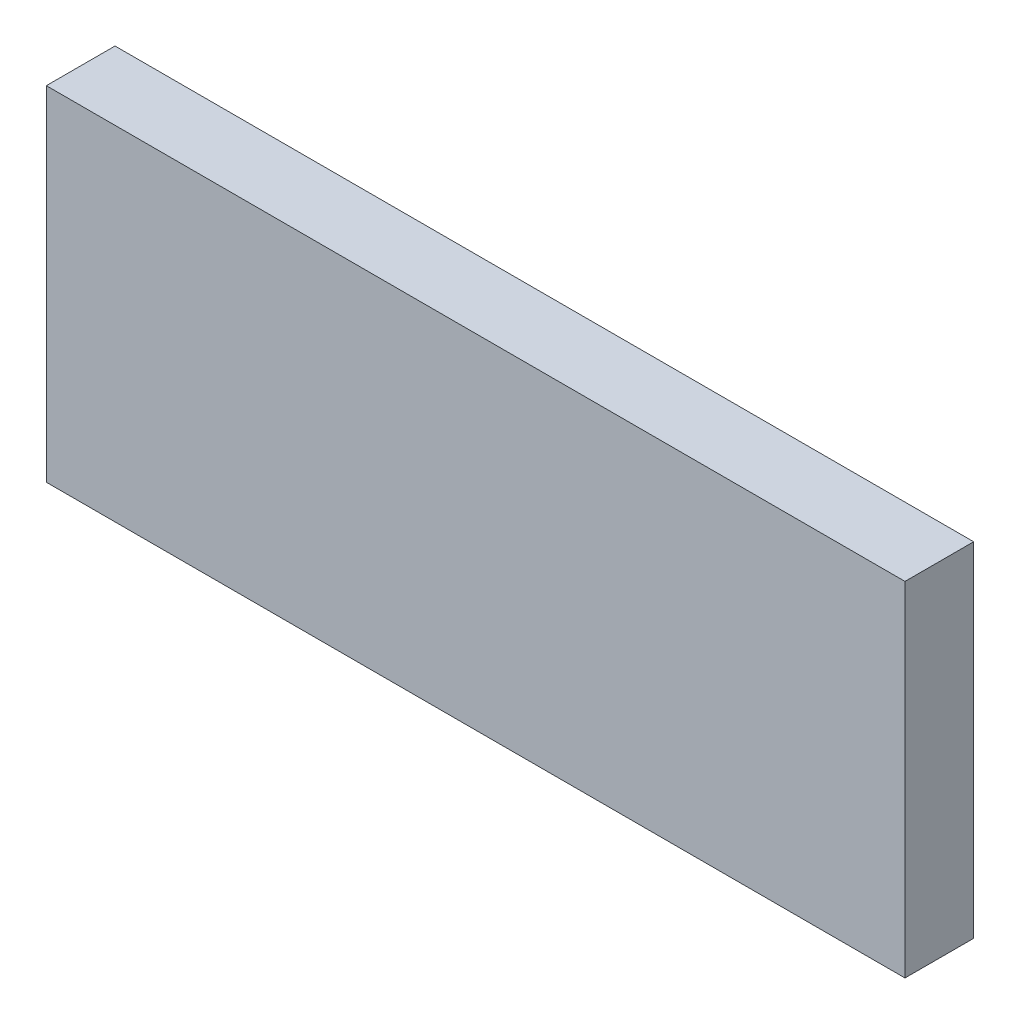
from build123d import *

# Parameters (mm, degrees)
SKETCH_1_W      = 100
SKETCH_1_H      = 40
EXTRUDE_1_DEPTH = 8


with BuildPart() as part:
    # Sketch 1 → Extrude 1 (new body)
    with BuildSketch(Plane.XY):
        with Locations((50, 20)):
            Rectangle(SKETCH_1_W, SKETCH_1_H)
    extrude(amount=EXTRUDE_1_DEPTH)


solid = part.part
